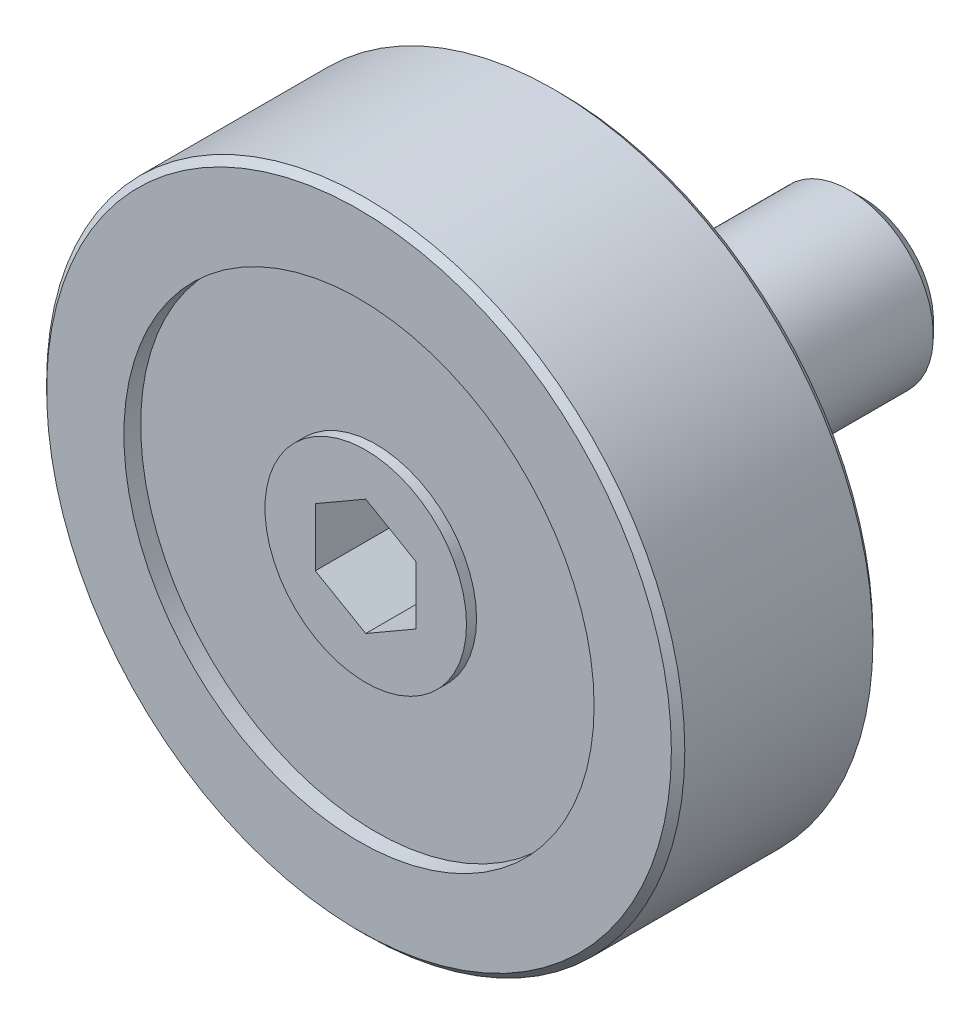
ISO-10303-21;
HEADER;
FILE_DESCRIPTION(('STEP AP214'),'2;1');
FILE_NAME('part.step','',(''),(''),'','','');
FILE_SCHEMA(('AUTOMOTIVE_DESIGN { 1 0 10303 214 1 1 1 1 }'));
ENDSEC;
DATA;
#1=APPLICATION_CONTEXT('core data for automotive mechanical design processes');
#2=APPLICATION_PROTOCOL_DEFINITION('international standard','automotive_design',2000,#1);
#3=PRODUCT_CONTEXT('',#1,'mechanical');
#4=PRODUCT('Part','Part','',(#3));
#5=PRODUCT_RELATED_PRODUCT_CATEGORY('part','',(#4));
#6=PRODUCT_DEFINITION_FORMATION('','',#4);
#7=PRODUCT_DEFINITION_CONTEXT('part definition',#1,'design');
#8=PRODUCT_DEFINITION('design','',#6,#7);
#9=PRODUCT_DEFINITION_SHAPE('','',#8);
#10=(LENGTH_UNIT() NAMED_UNIT(*) SI_UNIT(.MILLI.,.METRE.));
#11=(NAMED_UNIT(*) PLANE_ANGLE_UNIT() SI_UNIT($,.RADIAN.));
#12=(NAMED_UNIT(*) SI_UNIT($,.STERADIAN.) SOLID_ANGLE_UNIT());
#13=UNCERTAINTY_MEASURE_WITH_UNIT(LENGTH_MEASURE(1.E-05),#10,'distance_accuracy_value','');
#14=(GEOMETRIC_REPRESENTATION_CONTEXT(3) GLOBAL_UNCERTAINTY_ASSIGNED_CONTEXT((#13)) GLOBAL_UNIT_ASSIGNED_CONTEXT((#10,
#11,#12)) REPRESENTATION_CONTEXT('',''));
#15=CARTESIAN_POINT('',(0.,0.,0.));
#16=DIRECTION('',(0.,0.,1.));
#17=DIRECTION('',(1.,0.,0.));
#18=AXIS2_PLACEMENT_3D('',#15,#16,#17);
#19=CARTESIAN_POINT('',(0.,4.00000000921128,-5.82734880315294E-09));
#20=DIRECTION('',(0.,0.,1.));
#21=DIRECTION('',(1.,0.,0.));
#22=AXIS2_PLACEMENT_3D('',#19,#20,#21);
#23=PLANE('',#22);
#24=CARTESIAN_POINT('',(0.,9.21126900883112E-09,-5.82734901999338E-09));
#25=DIRECTION('',(0.,0.,1.));
#26=DIRECTION('',(1.,0.,0.));
#27=AXIS2_PLACEMENT_3D('',#24,#25,#26);
#28=CIRCLE('',#27,4.);
#29=CARTESIAN_POINT('',(4.,9.21126900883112E-09,-5.82734901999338E-09));
#30=VERTEX_POINT('',#29);
#31=EDGE_CURVE('E9',#30,#30,#28,.T.);
#32=ORIENTED_EDGE('',*,*,#31,.F.);
#33=EDGE_LOOP('',(#32));
#34=FACE_BOUND('',#33,.T.);
#35=CARTESIAN_POINT('',(0.,9.21126900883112E-09,-5.82734901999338E-09));
#36=DIRECTION('',(0.,0.,-1.));
#37=DIRECTION('',(-1.,0.,0.));
#38=AXIS2_PLACEMENT_3D('',#35,#36,#37);
#39=CIRCLE('',#38,2.);
#40=CARTESIAN_POINT('',(-2.,9.21126900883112E-09,-5.82734901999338E-09));
#41=VERTEX_POINT('',#40);
#42=EDGE_CURVE('E104',#41,#41,#39,.T.);
#43=ORIENTED_EDGE('',*,*,#42,.F.);
#44=EDGE_LOOP('',(#43));
#45=FACE_BOUND('',#44,.T.);
#46=ADVANCED_FACE('F14',(#34,#45),#23,.F.);
#47=CARTESIAN_POINT('',(0.,9.21126900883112E-09,9.99999999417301));
#48=DIRECTION('',(0.,0.,1.));
#49=DIRECTION('',(1.,0.,0.));
#50=AXIS2_PLACEMENT_3D('',#47,#48,#49);
#51=CYLINDRICAL_SURFACE('',#50,4.);
#52=CARTESIAN_POINT('',(0.,9.21126900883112E-09,1.49999999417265));
#53=DIRECTION('',(0.,0.,1.));
#54=DIRECTION('',(1.,0.,0.));
#55=AXIS2_PLACEMENT_3D('',#52,#53,#54);
#56=CIRCLE('',#55,4.);
#57=CARTESIAN_POINT('',(4.,9.21126900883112E-09,1.49999999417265));
#58=VERTEX_POINT('',#57);
#59=EDGE_CURVE('E22',#58,#58,#56,.T.);
#60=ORIENTED_EDGE('',*,*,#59,.F.);
#61=EDGE_LOOP('',(#60));
#62=FACE_BOUND('',#61,.T.);
#63=ORIENTED_EDGE('',*,*,#31,.T.);
#64=EDGE_LOOP('',(#63));
#65=FACE_BOUND('',#64,.T.);
#66=ADVANCED_FACE('F156',(#62,#65),#51,.T.);
#67=CARTESIAN_POINT('',(0.,4.00000000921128,1.49999999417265));
#68=DIRECTION('',(0.,0.,1.));
#69=DIRECTION('',(1.,0.,0.));
#70=AXIS2_PLACEMENT_3D('',#67,#68,#69);
#71=PLANE('',#70);
#72=CARTESIAN_POINT('',(0.,9.21126900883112E-09,1.49999999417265));
#73=DIRECTION('',(0.,0.,1.));
#74=DIRECTION('',(1.,0.,0.));
#75=AXIS2_PLACEMENT_3D('',#72,#73,#74);
#76=CIRCLE('',#75,6.99999999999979);
#77=CARTESIAN_POINT('',(6.99999999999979,9.21126900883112E-09,1.49999999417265));
#78=VERTEX_POINT('',#77);
#79=EDGE_CURVE('E149',#78,#78,#76,.T.);
#80=ORIENTED_EDGE('',*,*,#79,.F.);
#81=EDGE_LOOP('',(#80));
#82=FACE_BOUND('',#81,.T.);
#83=ORIENTED_EDGE('',*,*,#59,.T.);
#84=EDGE_LOOP('',(#83));
#85=FACE_BOUND('',#84,.T.);
#86=ADVANCED_FACE('F154',(#82,#85),#71,.F.);
#87=CARTESIAN_POINT('',(0.,9.21126900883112E-09,9.99999999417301));
#88=DIRECTION('',(0.,0.,1.));
#89=DIRECTION('',(1.,0.,0.));
#90=AXIS2_PLACEMENT_3D('',#87,#88,#89);
#91=CYLINDRICAL_SURFACE('',#90,6.99999999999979);
#92=CARTESIAN_POINT('',(0.,9.21126900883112E-09,0.999999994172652));
#93=DIRECTION('',(0.,0.,1.));
#94=DIRECTION('',(1.,0.,0.));
#95=AXIS2_PLACEMENT_3D('',#92,#93,#94);
#96=CIRCLE('',#95,6.99999999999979);
#97=CARTESIAN_POINT('',(6.99999999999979,9.21126900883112E-09,0.999999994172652));
#98=VERTEX_POINT('',#97);
#99=EDGE_CURVE('E146',#98,#98,#96,.T.);
#100=ORIENTED_EDGE('',*,*,#99,.F.);
#101=EDGE_LOOP('',(#100));
#102=FACE_BOUND('',#101,.T.);
#103=ORIENTED_EDGE('',*,*,#79,.T.);
#104=EDGE_LOOP('',(#103));
#105=FACE_BOUND('',#104,.T.);
#106=ADVANCED_FACE('F237',(#102,#105),#91,.F.);
#107=CARTESIAN_POINT('',(0.,9.30000000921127,0.999999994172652));
#108=DIRECTION('',(0.,0.,1.));
#109=DIRECTION('',(1.,0.,0.));
#110=AXIS2_PLACEMENT_3D('',#107,#108,#109);
#111=PLANE('',#110);
#112=CARTESIAN_POINT('',(0.,9.21126900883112E-09,0.999999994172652));
#113=DIRECTION('',(0.,0.,1.));
#114=DIRECTION('',(1.,0.,0.));
#115=AXIS2_PLACEMENT_3D('',#112,#113,#114);
#116=CIRCLE('',#115,9.3);
#117=CARTESIAN_POINT('',(9.3,9.21126900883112E-09,0.999999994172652));
#118=VERTEX_POINT('',#117);
#119=EDGE_CURVE('E143',#118,#118,#116,.T.);
#120=ORIENTED_EDGE('',*,*,#119,.F.);
#121=EDGE_LOOP('',(#120));
#122=FACE_BOUND('',#121,.T.);
#123=ORIENTED_EDGE('',*,*,#99,.T.);
#124=EDGE_LOOP('',(#123));
#125=FACE_BOUND('',#124,.T.);
#126=ADVANCED_FACE('F233',(#122,#125),#111,.F.);
#127=CARTESIAN_POINT('',(0.,9.21126900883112E-09,0.999999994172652));
#128=DIRECTION('',(0.,0.,1.));
#129=DIRECTION('',(1.,0.,0.));
#130=AXIS2_PLACEMENT_3D('',#127,#128,#129);
#131=CONICAL_SURFACE('',#130,9.3,0.785398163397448);
#132=CARTESIAN_POINT('',(0.,9.21126900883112E-09,1.19999999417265));
#133=DIRECTION('',(0.,0.,1.));
#134=DIRECTION('',(1.,0.,0.));
#135=AXIS2_PLACEMENT_3D('',#132,#133,#134);
#136=CIRCLE('',#135,9.5);
#137=CARTESIAN_POINT('',(9.5,9.21126900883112E-09,1.19999999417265));
#138=VERTEX_POINT('',#137);
#139=EDGE_CURVE('E140',#138,#138,#136,.T.);
#140=ORIENTED_EDGE('',*,*,#139,.F.);
#141=EDGE_LOOP('',(#140));
#142=FACE_BOUND('',#141,.T.);
#143=ORIENTED_EDGE('',*,*,#119,.T.);
#144=EDGE_LOOP('',(#143));
#145=FACE_BOUND('',#144,.T.);
#146=ADVANCED_FACE('F229',(#142,#145),#131,.T.);
#147=CARTESIAN_POINT('',(0.,9.21126900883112E-09,9.99999999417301));
#148=DIRECTION('',(0.,0.,1.));
#149=DIRECTION('',(1.,0.,0.));
#150=AXIS2_PLACEMENT_3D('',#147,#148,#149);
#151=CYLINDRICAL_SURFACE('',#150,9.5);
#152=CARTESIAN_POINT('',(0.,9.21126900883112E-09,6.799999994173));
#153=DIRECTION('',(0.,0.,1.));
#154=DIRECTION('',(1.,0.,0.));
#155=AXIS2_PLACEMENT_3D('',#152,#153,#154);
#156=CIRCLE('',#155,9.5);
#157=CARTESIAN_POINT('',(9.5,9.21126900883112E-09,6.799999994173));
#158=VERTEX_POINT('',#157);
#159=EDGE_CURVE('E137',#158,#158,#156,.T.);
#160=ORIENTED_EDGE('',*,*,#159,.F.);
#161=EDGE_LOOP('',(#160));
#162=FACE_BOUND('',#161,.T.);
#163=ORIENTED_EDGE('',*,*,#139,.T.);
#164=EDGE_LOOP('',(#163));
#165=FACE_BOUND('',#164,.T.);
#166=ADVANCED_FACE('F225',(#162,#165),#151,.T.);
#167=CARTESIAN_POINT('',(0.,9.21126900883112E-09,6.799999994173));
#168=DIRECTION('',(0.,0.,-1.));
#169=DIRECTION('',(-1.,0.,0.));
#170=AXIS2_PLACEMENT_3D('',#167,#168,#169);
#171=CONICAL_SURFACE('',#170,9.5,0.78539816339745);
#172=CARTESIAN_POINT('',(0.,9.21126900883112E-09,6.999999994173));
#173=DIRECTION('',(0.,0.,1.));
#174=DIRECTION('',(1.,0.,0.));
#175=AXIS2_PLACEMENT_3D('',#172,#173,#174);
#176=CIRCLE('',#175,9.3);
#177=CARTESIAN_POINT('',(9.3,9.21126900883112E-09,6.999999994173));
#178=VERTEX_POINT('',#177);
#179=EDGE_CURVE('E134',#178,#178,#176,.T.);
#180=ORIENTED_EDGE('',*,*,#179,.F.);
#181=EDGE_LOOP('',(#180));
#182=FACE_BOUND('',#181,.T.);
#183=ORIENTED_EDGE('',*,*,#159,.T.);
#184=EDGE_LOOP('',(#183));
#185=FACE_BOUND('',#184,.T.);
#186=ADVANCED_FACE('F221',(#182,#185),#171,.T.);
#187=CARTESIAN_POINT('',(0.,9.30000000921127,6.999999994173));
#188=DIRECTION('',(0.,0.,-1.));
#189=DIRECTION('',(-1.,0.,0.));
#190=AXIS2_PLACEMENT_3D('',#187,#188,#189);
#191=PLANE('',#190);
#192=CARTESIAN_POINT('',(0.,9.21126900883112E-09,6.999999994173));
#193=DIRECTION('',(0.,0.,1.));
#194=DIRECTION('',(1.,0.,0.));
#195=AXIS2_PLACEMENT_3D('',#192,#193,#194);
#196=CIRCLE('',#195,7.);
#197=CARTESIAN_POINT('',(7.,9.21126900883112E-09,6.999999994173));
#198=VERTEX_POINT('',#197);
#199=EDGE_CURVE('E131',#198,#198,#196,.T.);
#200=ORIENTED_EDGE('',*,*,#199,.F.);
#201=EDGE_LOOP('',(#200));
#202=FACE_BOUND('',#201,.T.);
#203=ORIENTED_EDGE('',*,*,#179,.T.);
#204=EDGE_LOOP('',(#203));
#205=FACE_BOUND('',#204,.T.);
#206=ADVANCED_FACE('F217',(#202,#205),#191,.F.);
#207=CARTESIAN_POINT('',(0.,9.21126900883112E-09,9.99999999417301));
#208=DIRECTION('',(0.,0.,1.));
#209=DIRECTION('',(1.,0.,0.));
#210=AXIS2_PLACEMENT_3D('',#207,#208,#209);
#211=CYLINDRICAL_SURFACE('',#210,7.);
#212=CARTESIAN_POINT('',(0.,9.21126900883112E-09,6.499999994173));
#213=DIRECTION('',(0.,0.,1.));
#214=DIRECTION('',(1.,0.,0.));
#215=AXIS2_PLACEMENT_3D('',#212,#213,#214);
#216=CIRCLE('',#215,7.);
#217=CARTESIAN_POINT('',(7.,9.21126900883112E-09,6.499999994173));
#218=VERTEX_POINT('',#217);
#219=EDGE_CURVE('E128',#218,#218,#216,.T.);
#220=ORIENTED_EDGE('',*,*,#219,.F.);
#221=EDGE_LOOP('',(#220));
#222=FACE_BOUND('',#221,.T.);
#223=ORIENTED_EDGE('',*,*,#199,.T.);
#224=EDGE_LOOP('',(#223));
#225=FACE_BOUND('',#224,.T.);
#226=ADVANCED_FACE('F213',(#222,#225),#211,.F.);
#227=CARTESIAN_POINT('',(0.,3.00000000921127,6.499999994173));
#228=DIRECTION('',(0.,0.,-1.));
#229=DIRECTION('',(-1.,0.,0.));
#230=AXIS2_PLACEMENT_3D('',#227,#228,#229);
#231=PLANE('',#230);
#232=CARTESIAN_POINT('',(0.,9.21126900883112E-09,6.499999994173));
#233=DIRECTION('',(0.,0.,1.));
#234=DIRECTION('',(1.,0.,0.));
#235=AXIS2_PLACEMENT_3D('',#232,#233,#234);
#236=CIRCLE('',#235,3.);
#237=CARTESIAN_POINT('',(3.,9.21126900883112E-09,6.499999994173));
#238=VERTEX_POINT('',#237);
#239=EDGE_CURVE('E125',#238,#238,#236,.T.);
#240=ORIENTED_EDGE('',*,*,#239,.F.);
#241=EDGE_LOOP('',(#240));
#242=FACE_BOUND('',#241,.T.);
#243=ORIENTED_EDGE('',*,*,#219,.T.);
#244=EDGE_LOOP('',(#243));
#245=FACE_BOUND('',#244,.T.);
#246=ADVANCED_FACE('F209',(#242,#245),#231,.F.);
#247=CARTESIAN_POINT('',(0.,9.21126900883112E-09,9.99999999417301));
#248=DIRECTION('',(0.,0.,1.));
#249=DIRECTION('',(1.,0.,0.));
#250=AXIS2_PLACEMENT_3D('',#247,#248,#249);
#251=CYLINDRICAL_SURFACE('',#250,3.);
#252=CARTESIAN_POINT('',(0.,9.21126900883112E-09,6.79999999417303));
#253=DIRECTION('',(0.,0.,1.));
#254=DIRECTION('',(1.,0.,0.));
#255=AXIS2_PLACEMENT_3D('',#252,#253,#254);
#256=CIRCLE('',#255,3.);
#257=CARTESIAN_POINT('',(3.,9.21126900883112E-09,6.79999999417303));
#258=VERTEX_POINT('',#257);
#259=EDGE_CURVE('E117',#258,#258,#256,.T.);
#260=ORIENTED_EDGE('',*,*,#259,.F.);
#261=EDGE_LOOP('',(#260));
#262=FACE_BOUND('',#261,.T.);
#263=ORIENTED_EDGE('',*,*,#239,.T.);
#264=EDGE_LOOP('',(#263));
#265=FACE_BOUND('',#264,.T.);
#266=ADVANCED_FACE('F206',(#262,#265),#251,.T.);
#267=CARTESIAN_POINT('',(0.,3.00000000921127,6.79999999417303));
#268=DIRECTION('',(0.,0.,-1.));
#269=DIRECTION('',(-1.,0.,0.));
#270=AXIS2_PLACEMENT_3D('',#267,#268,#269);
#271=PLANE('',#270);
#272=DIRECTION('',(-0.866025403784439,-0.5,0.));
#273=VECTOR('',#272,1.);
#274=CARTESIAN_POINT('',(0.,1.73205080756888,6.79999999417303));
#275=LINE('',#274,#273);
#276=CARTESIAN_POINT('',(0.,1.73205080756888,6.79999999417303));
#277=VERTEX_POINT('',#276);
#278=CARTESIAN_POINT('',(-1.5,0.866025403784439,6.79999999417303));
#279=VERTEX_POINT('',#278);
#280=EDGE_CURVE('E103',#277,#279,#275,.T.);
#281=ORIENTED_EDGE('',*,*,#280,.F.);
#282=DIRECTION('',(-0.866025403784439,0.5,0.));
#283=VECTOR('',#282,1.);
#284=CARTESIAN_POINT('',(1.5,0.866025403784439,6.79999999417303));
#285=LINE('',#284,#283);
#286=CARTESIAN_POINT('',(1.5,0.866025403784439,6.79999999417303));
#287=VERTEX_POINT('',#286);
#288=EDGE_CURVE('E29',#287,#277,#285,.T.);
#289=ORIENTED_EDGE('',*,*,#288,.F.);
#290=DIRECTION('',(0.,1.,0.));
#291=VECTOR('',#290,1.);
#292=CARTESIAN_POINT('',(1.5,-0.866025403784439,6.79999999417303));
#293=LINE('',#292,#291);
#294=CARTESIAN_POINT('',(1.5,-0.866025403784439,6.79999999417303));
#295=VERTEX_POINT('',#294);
#296=EDGE_CURVE('E113',#295,#287,#293,.T.);
#297=ORIENTED_EDGE('',*,*,#296,.F.);
#298=DIRECTION('',(0.866025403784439,0.5,0.));
#299=VECTOR('',#298,1.);
#300=CARTESIAN_POINT('',(0.,-1.73205080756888,6.79999999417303));
#301=LINE('',#300,#299);
#302=CARTESIAN_POINT('',(0.,-1.73205080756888,6.79999999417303));
#303=VERTEX_POINT('',#302);
#304=EDGE_CURVE('E111',#303,#295,#301,.T.);
#305=ORIENTED_EDGE('',*,*,#304,.F.);
#306=DIRECTION('',(0.866025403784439,-0.5,0.));
#307=VECTOR('',#306,1.);
#308=CARTESIAN_POINT('',(-1.5,-0.866025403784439,6.79999999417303));
#309=LINE('',#308,#307);
#310=CARTESIAN_POINT('',(-1.5,-0.866025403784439,6.79999999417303));
#311=VERTEX_POINT('',#310);
#312=EDGE_CURVE('E77',#311,#303,#309,.T.);
#313=ORIENTED_EDGE('',*,*,#312,.F.);
#314=DIRECTION('',(0.,-1.,0.));
#315=VECTOR('',#314,1.);
#316=CARTESIAN_POINT('',(-1.5,0.866025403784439,6.79999999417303));
#317=LINE('',#316,#315);
#318=EDGE_CURVE('E107',#279,#311,#317,.T.);
#319=ORIENTED_EDGE('',*,*,#318,.F.);
#320=EDGE_LOOP('',(#281,#289,#297,#305,#313,#319));
#321=FACE_BOUND('',#320,.T.);
#322=ORIENTED_EDGE('',*,*,#259,.T.);
#323=EDGE_LOOP('',(#322));
#324=FACE_BOUND('',#323,.T.);
#325=ADVANCED_FACE('F181',(#321,#324),#271,.F.);
#326=CARTESIAN_POINT('',(1.5,0.866025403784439,4.29999999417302));
#327=DIRECTION('',(0.5,0.866025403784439,0.));
#328=DIRECTION('',(-0.866025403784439,0.5,0.));
#329=AXIS2_PLACEMENT_3D('',#326,#327,#328);
#330=PLANE('',#329);
#331=ORIENTED_EDGE('',*,*,#288,.T.);
#332=DIRECTION('',(0.,0.,1.));
#333=VECTOR('',#332,1.);
#334=CARTESIAN_POINT('',(0.,1.73205080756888,4.29999999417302));
#335=LINE('',#334,#333);
#336=CARTESIAN_POINT('',(0.,1.73205080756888,4.29999999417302));
#337=VERTEX_POINT('',#336);
#338=EDGE_CURVE('E59',#337,#277,#335,.T.);
#339=ORIENTED_EDGE('',*,*,#338,.F.);
#340=DIRECTION('',(-0.866025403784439,0.5,0.));
#341=VECTOR('',#340,1.);
#342=CARTESIAN_POINT('',(1.5,0.866025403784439,4.29999999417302));
#343=LINE('',#342,#341);
#344=CARTESIAN_POINT('',(1.5,0.866025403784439,4.29999999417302));
#345=VERTEX_POINT('',#344);
#346=EDGE_CURVE('E115',#345,#337,#343,.T.);
#347=ORIENTED_EDGE('',*,*,#346,.F.);
#348=DIRECTION('',(0.,0.,1.));
#349=VECTOR('',#348,1.);
#350=CARTESIAN_POINT('',(1.5,0.866025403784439,4.29999999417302));
#351=LINE('',#350,#349);
#352=EDGE_CURVE('E37',#345,#287,#351,.T.);
#353=ORIENTED_EDGE('',*,*,#352,.T.);
#354=EDGE_LOOP('',(#331,#339,#347,#353));
#355=FACE_BOUND('',#354,.T.);
#356=ADVANCED_FACE('F186',(#355),#330,.F.);
#357=CARTESIAN_POINT('',(1.5,-0.866025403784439,4.29999999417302));
#358=DIRECTION('',(1.,0.,0.));
#359=DIRECTION('',(0.,0.,-1.));
#360=AXIS2_PLACEMENT_3D('',#357,#358,#359);
#361=PLANE('',#360);
#362=ORIENTED_EDGE('',*,*,#296,.T.);
#363=ORIENTED_EDGE('',*,*,#352,.F.);
#364=DIRECTION('',(0.,1.,0.));
#365=VECTOR('',#364,1.);
#366=CARTESIAN_POINT('',(1.5,-0.866025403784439,4.29999999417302));
#367=LINE('',#366,#365);
#368=CARTESIAN_POINT('',(1.5,-0.866025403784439,4.29999999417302));
#369=VERTEX_POINT('',#368);
#370=EDGE_CURVE('E89',#369,#345,#367,.T.);
#371=ORIENTED_EDGE('',*,*,#370,.F.);
#372=DIRECTION('',(0.,0.,1.));
#373=VECTOR('',#372,1.);
#374=CARTESIAN_POINT('',(1.5,-0.866025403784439,4.29999999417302));
#375=LINE('',#374,#373);
#376=EDGE_CURVE('E81',#369,#295,#375,.T.);
#377=ORIENTED_EDGE('',*,*,#376,.T.);
#378=EDGE_LOOP('',(#362,#363,#371,#377));
#379=FACE_BOUND('',#378,.T.);
#380=ADVANCED_FACE('F184',(#379),#361,.F.);
#381=CARTESIAN_POINT('',(0.,-1.73205080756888,4.29999999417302));
#382=DIRECTION('',(0.5,-0.866025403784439,0.));
#383=DIRECTION('',(0.866025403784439,0.5,0.));
#384=AXIS2_PLACEMENT_3D('',#381,#382,#383);
#385=PLANE('',#384);
#386=ORIENTED_EDGE('',*,*,#304,.T.);
#387=ORIENTED_EDGE('',*,*,#376,.F.);
#388=DIRECTION('',(0.866025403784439,0.5,0.));
#389=VECTOR('',#388,1.);
#390=CARTESIAN_POINT('',(0.,-1.73205080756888,4.29999999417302));
#391=LINE('',#390,#389);
#392=CARTESIAN_POINT('',(0.,-1.73205080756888,4.29999999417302));
#393=VERTEX_POINT('',#392);
#394=EDGE_CURVE('E85',#393,#369,#391,.T.);
#395=ORIENTED_EDGE('',*,*,#394,.F.);
#396=DIRECTION('',(0.,0.,1.));
#397=VECTOR('',#396,1.);
#398=CARTESIAN_POINT('',(0.,-1.73205080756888,4.29999999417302));
#399=LINE('',#398,#397);
#400=EDGE_CURVE('E70',#393,#303,#399,.T.);
#401=ORIENTED_EDGE('',*,*,#400,.T.);
#402=EDGE_LOOP('',(#386,#387,#395,#401));
#403=FACE_BOUND('',#402,.T.);
#404=ADVANCED_FACE('F86',(#403),#385,.F.);
#405=CARTESIAN_POINT('',(-1.5,-0.866025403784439,4.29999999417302));
#406=DIRECTION('',(-0.5,-0.866025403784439,0.));
#407=DIRECTION('',(0.866025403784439,-0.5,0.));
#408=AXIS2_PLACEMENT_3D('',#405,#406,#407);
#409=PLANE('',#408);
#410=ORIENTED_EDGE('',*,*,#312,.T.);
#411=ORIENTED_EDGE('',*,*,#400,.F.);
#412=DIRECTION('',(0.866025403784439,-0.5,0.));
#413=VECTOR('',#412,1.);
#414=CARTESIAN_POINT('',(-1.5,-0.866025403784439,4.29999999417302));
#415=LINE('',#414,#413);
#416=CARTESIAN_POINT('',(-1.5,-0.866025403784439,4.29999999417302));
#417=VERTEX_POINT('',#416);
#418=EDGE_CURVE('E74',#417,#393,#415,.T.);
#419=ORIENTED_EDGE('',*,*,#418,.F.);
#420=DIRECTION('',(0.,0.,1.));
#421=VECTOR('',#420,1.);
#422=CARTESIAN_POINT('',(-1.5,-0.866025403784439,4.29999999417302));
#423=LINE('',#422,#421);
#424=EDGE_CURVE('E82',#417,#311,#423,.T.);
#425=ORIENTED_EDGE('',*,*,#424,.T.);
#426=EDGE_LOOP('',(#410,#411,#419,#425));
#427=FACE_BOUND('',#426,.T.);
#428=ADVANCED_FACE('F72',(#427),#409,.F.);
#429=CARTESIAN_POINT('',(-1.5,0.866025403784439,4.29999999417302));
#430=DIRECTION('',(-1.,0.,0.));
#431=DIRECTION('',(0.,-1.,0.));
#432=AXIS2_PLACEMENT_3D('',#429,#430,#431);
#433=PLANE('',#432);
#434=ORIENTED_EDGE('',*,*,#318,.T.);
#435=ORIENTED_EDGE('',*,*,#424,.F.);
#436=DIRECTION('',(0.,-1.,0.));
#437=VECTOR('',#436,1.);
#438=CARTESIAN_POINT('',(-1.5,0.866025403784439,4.29999999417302));
#439=LINE('',#438,#437);
#440=CARTESIAN_POINT('',(-1.5,0.866025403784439,4.29999999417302));
#441=VERTEX_POINT('',#440);
#442=EDGE_CURVE('E95',#441,#417,#439,.T.);
#443=ORIENTED_EDGE('',*,*,#442,.F.);
#444=DIRECTION('',(0.,0.,1.));
#445=VECTOR('',#444,1.);
#446=CARTESIAN_POINT('',(-1.5,0.866025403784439,4.29999999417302));
#447=LINE('',#446,#445);
#448=EDGE_CURVE('E120',#441,#279,#447,.T.);
#449=ORIENTED_EDGE('',*,*,#448,.T.);
#450=EDGE_LOOP('',(#434,#435,#443,#449));
#451=FACE_BOUND('',#450,.T.);
#452=ADVANCED_FACE('F179',(#451),#433,.F.);
#453=CARTESIAN_POINT('',(0.,1.73205080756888,4.29999999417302));
#454=DIRECTION('',(-0.5,0.866025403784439,0.));
#455=DIRECTION('',(-0.866025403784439,-0.5,0.));
#456=AXIS2_PLACEMENT_3D('',#453,#454,#455);
#457=PLANE('',#456);
#458=ORIENTED_EDGE('',*,*,#280,.T.);
#459=ORIENTED_EDGE('',*,*,#448,.F.);
#460=DIRECTION('',(-0.866025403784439,-0.5,0.));
#461=VECTOR('',#460,1.);
#462=CARTESIAN_POINT('',(0.,1.73205080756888,4.29999999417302));
#463=LINE('',#462,#461);
#464=EDGE_CURVE('E97',#337,#441,#463,.T.);
#465=ORIENTED_EDGE('',*,*,#464,.F.);
#466=ORIENTED_EDGE('',*,*,#338,.T.);
#467=EDGE_LOOP('',(#458,#459,#465,#466));
#468=FACE_BOUND('',#467,.T.);
#469=ADVANCED_FACE('F175',(#468),#457,.F.);
#470=CARTESIAN_POINT('',(0.,0.,4.29999999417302));
#471=DIRECTION('',(0.,0.,1.));
#472=DIRECTION('',(1.,0.,0.));
#473=AXIS2_PLACEMENT_3D('',#470,#471,#472);
#474=PLANE('',#473);
#475=ORIENTED_EDGE('',*,*,#346,.T.);
#476=ORIENTED_EDGE('',*,*,#464,.T.);
#477=ORIENTED_EDGE('',*,*,#442,.T.);
#478=ORIENTED_EDGE('',*,*,#418,.T.);
#479=ORIENTED_EDGE('',*,*,#394,.T.);
#480=ORIENTED_EDGE('',*,*,#370,.T.);
#481=EDGE_LOOP('',(#475,#476,#477,#478,#479,#480));
#482=FACE_BOUND('',#481,.T.);
#483=ADVANCED_FACE('F92',(#482),#474,.T.);
#484=CARTESIAN_POINT('',(0.,9.21126900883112E-09,-8.00000000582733));
#485=DIRECTION('',(0.,0.,-1.));
#486=DIRECTION('',(-1.,0.,0.));
#487=AXIS2_PLACEMENT_3D('',#484,#485,#486);
#488=CYLINDRICAL_SURFACE('',#487,2.);
#489=CARTESIAN_POINT('',(0.,9.21126900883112E-09,-1.60000000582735));
#490=DIRECTION('',(0.,0.,-1.));
#491=DIRECTION('',(-1.,0.,0.));
#492=AXIS2_PLACEMENT_3D('',#489,#490,#491);
#493=CIRCLE('',#492,2.);
#494=CARTESIAN_POINT('',(-2.,9.21126900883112E-09,-1.60000000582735));
#495=VERTEX_POINT('',#494);
#496=EDGE_CURVE('E167',#495,#495,#493,.T.);
#497=ORIENTED_EDGE('',*,*,#496,.F.);
#498=EDGE_LOOP('',(#497));
#499=FACE_BOUND('',#498,.T.);
#500=ORIENTED_EDGE('',*,*,#42,.T.);
#501=EDGE_LOOP('',(#500));
#502=FACE_BOUND('',#501,.T.);
#503=ADVANCED_FACE('F349',(#499,#502),#488,.T.);
#504=CARTESIAN_POINT('',(0.,2.00000000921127,-1.60000000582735));
#505=DIRECTION('',(0.,0.,-1.));
#506=DIRECTION('',(-1.,0.,0.));
#507=AXIS2_PLACEMENT_3D('',#504,#505,#506);
#508=PLANE('',#507);
#509=CARTESIAN_POINT('',(0.,9.21126900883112E-09,-1.60000000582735));
#510=DIRECTION('',(0.,0.,-1.));
#511=DIRECTION('',(-1.,0.,0.));
#512=AXIS2_PLACEMENT_3D('',#509,#510,#511);
#513=CIRCLE('',#512,2.5);
#514=CARTESIAN_POINT('',(-2.5,9.21126900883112E-09,-1.60000000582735));
#515=VERTEX_POINT('',#514);
#516=EDGE_CURVE('E170',#515,#515,#513,.T.);
#517=ORIENTED_EDGE('',*,*,#516,.F.);
#518=EDGE_LOOP('',(#517));
#519=FACE_BOUND('',#518,.T.);
#520=ORIENTED_EDGE('',*,*,#496,.T.);
#521=EDGE_LOOP('',(#520));
#522=FACE_BOUND('',#521,.T.);
#523=ADVANCED_FACE('F358',(#519,#522),#508,.F.);
#524=CARTESIAN_POINT('',(0.,9.21126900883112E-09,-8.00000000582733));
#525=DIRECTION('',(0.,0.,-1.));
#526=DIRECTION('',(-1.,0.,0.));
#527=AXIS2_PLACEMENT_3D('',#524,#525,#526);
#528=CYLINDRICAL_SURFACE('',#527,2.5);
#529=CARTESIAN_POINT('',(0.,9.21126900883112E-09,-7.60000000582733));
#530=DIRECTION('',(0.,0.,-1.));
#531=DIRECTION('',(-1.,0.,0.));
#532=AXIS2_PLACEMENT_3D('',#529,#530,#531);
#533=CIRCLE('',#532,2.5);
#534=CARTESIAN_POINT('',(-2.5,9.21126900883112E-09,-7.60000000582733));
#535=VERTEX_POINT('',#534);
#536=EDGE_CURVE('E402',#535,#535,#533,.T.);
#537=ORIENTED_EDGE('',*,*,#536,.F.);
#538=EDGE_LOOP('',(#537));
#539=FACE_BOUND('',#538,.T.);
#540=ORIENTED_EDGE('',*,*,#516,.T.);
#541=EDGE_LOOP('',(#540));
#542=FACE_BOUND('',#541,.T.);
#543=ADVANCED_FACE('F367',(#539,#542),#528,.T.);
#544=CARTESIAN_POINT('',(0.,9.21126900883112E-09,-7.60000000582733));
#545=DIRECTION('',(0.,0.,1.));
#546=DIRECTION('',(1.,0.,0.));
#547=AXIS2_PLACEMENT_3D('',#544,#545,#546);
#548=CONICAL_SURFACE('',#547,2.5,0.78539816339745);
#549=CARTESIAN_POINT('',(0.,9.21126900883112E-09,-8.00000000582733));
#550=DIRECTION('',(0.,0.,-1.));
#551=DIRECTION('',(-1.,0.,0.));
#552=AXIS2_PLACEMENT_3D('',#549,#550,#551);
#553=CIRCLE('',#552,2.1);
#554=CARTESIAN_POINT('',(-2.1,9.21126900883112E-09,-8.00000000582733));
#555=VERTEX_POINT('',#554);
#556=EDGE_CURVE('E401',#555,#555,#553,.T.);
#557=ORIENTED_EDGE('',*,*,#556,.F.);
#558=EDGE_LOOP('',(#557));
#559=FACE_BOUND('',#558,.T.);
#560=ORIENTED_EDGE('',*,*,#536,.T.);
#561=EDGE_LOOP('',(#560));
#562=FACE_BOUND('',#561,.T.);
#563=ADVANCED_FACE('F377',(#559,#562),#548,.T.);
#564=CARTESIAN_POINT('',(0.,9.21126900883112E-09,-8.00000000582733));
#565=DIRECTION('',(0.,0.,1.));
#566=DIRECTION('',(1.,0.,0.));
#567=AXIS2_PLACEMENT_3D('',#564,#565,#566);
#568=PLANE('',#567);
#569=ORIENTED_EDGE('',*,*,#556,.T.);
#570=EDGE_LOOP('',(#569));
#571=FACE_BOUND('',#570,.T.);
#572=ADVANCED_FACE('F16',(#571),#568,.F.);
#573=CLOSED_SHELL('',(#46,#66,#86,#106,#126,#146,#166,#186,#206,#226,#246,#266,#325,#356,#380,
#404,#428,#452,#469,#483,#503,#523,#543,#563,#572));
#574=MANIFOLD_SOLID_BREP('B1',#573);
#575=ADVANCED_BREP_SHAPE_REPRESENTATION('',(#18,#574),#14);
#576=SHAPE_DEFINITION_REPRESENTATION(#9,#575);
ENDSEC;
END-ISO-10303-21;
